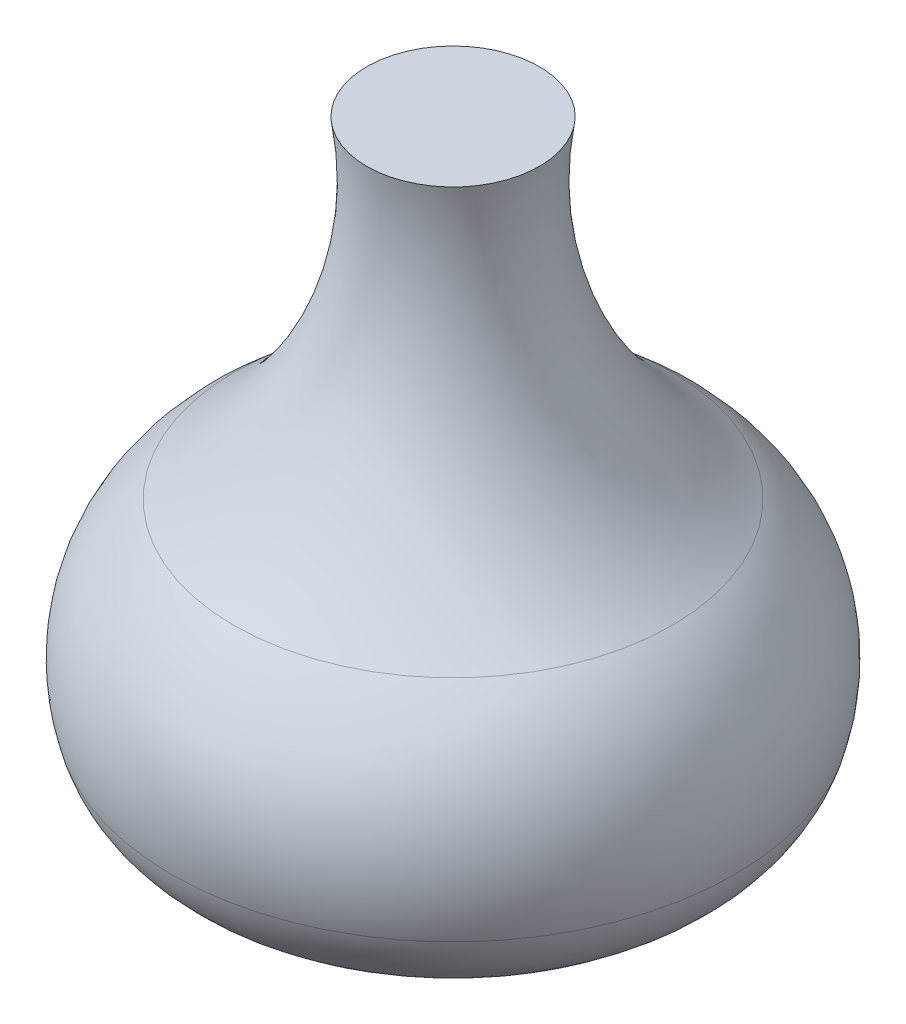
ISO-10303-21;
HEADER;
FILE_DESCRIPTION(('STEP AP214'),'2;1');
FILE_NAME('part.step','',(''),(''),'','','');
FILE_SCHEMA(('AUTOMOTIVE_DESIGN { 1 0 10303 214 1 1 1 1 }'));
ENDSEC;
DATA;
#1=APPLICATION_CONTEXT('core data for automotive mechanical design processes');
#2=APPLICATION_PROTOCOL_DEFINITION('international standard','automotive_design',2000,#1);
#3=PRODUCT_CONTEXT('',#1,'mechanical');
#4=PRODUCT('Part','Part','',(#3));
#5=PRODUCT_RELATED_PRODUCT_CATEGORY('part','',(#4));
#6=PRODUCT_DEFINITION_FORMATION('','',#4);
#7=PRODUCT_DEFINITION_CONTEXT('part definition',#1,'design');
#8=PRODUCT_DEFINITION('design','',#6,#7);
#9=PRODUCT_DEFINITION_SHAPE('','',#8);
#10=(LENGTH_UNIT() NAMED_UNIT(*) SI_UNIT(.MILLI.,.METRE.));
#11=(NAMED_UNIT(*) PLANE_ANGLE_UNIT() SI_UNIT($,.RADIAN.));
#12=(NAMED_UNIT(*) SI_UNIT($,.STERADIAN.) SOLID_ANGLE_UNIT());
#13=UNCERTAINTY_MEASURE_WITH_UNIT(LENGTH_MEASURE(1.E-05),#10,'distance_accuracy_value','');
#14=(GEOMETRIC_REPRESENTATION_CONTEXT(3) GLOBAL_UNCERTAINTY_ASSIGNED_CONTEXT((#13)) GLOBAL_UNIT_ASSIGNED_CONTEXT((#10,
#11,#12)) REPRESENTATION_CONTEXT('',''));
#15=CARTESIAN_POINT('',(0.,0.,0.));
#16=DIRECTION('',(0.,0.,1.));
#17=DIRECTION('',(1.,0.,0.));
#18=AXIS2_PLACEMENT_3D('',#15,#16,#17);
#19=CARTESIAN_POINT('',(0.,53.0411764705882,0.));
#20=DIRECTION('',(0.,1.,0.));
#21=DIRECTION('',(0.,0.,1.));
#22=AXIS2_PLACEMENT_3D('',#19,#20,#21);
#23=PLANE('',#22);
#24=CARTESIAN_POINT('',(0.,53.0411764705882,0.));
#25=DIRECTION('',(0.,1.,0.));
#26=DIRECTION('',(0.,0.,1.));
#27=AXIS2_PLACEMENT_3D('',#24,#25,#26);
#28=CIRCLE('',#27,15.);
#29=CARTESIAN_POINT('',(0.,53.0411764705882,15.));
#30=VERTEX_POINT('',#29);
#31=EDGE_CURVE('E10',#30,#30,#28,.T.);
#32=ORIENTED_EDGE('',*,*,#31,.T.);
#33=EDGE_LOOP('',(#32));
#34=FACE_BOUND('',#33,.T.);
#35=ADVANCED_FACE('F29',(#34),#23,.T.);
#36=CARTESIAN_POINT('',(0.,43.4006403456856,0.));
#37=DIRECTION('',(0.,1.,0.));
#38=DIRECTION('',(0.,0.,1.));
#39=AXIS2_PLACEMENT_3D('',#36,#37,#38);
#40=TOROIDAL_SURFACE('',#39,74.2204361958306,60.);
#41=CARTESIAN_POINT('',(0.,-4.48702608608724,0.));
#42=DIRECTION('',(0.,1.,0.));
#43=DIRECTION('',(0.,0.,1.));
#44=AXIS2_PLACEMENT_3D('',#41,#42,#43);
#45=CIRCLE('',#44,38.0711429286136);
#46=CARTESIAN_POINT('',(0.,-4.48702608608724,38.0711429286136));
#47=VERTEX_POINT('',#46);
#48=EDGE_CURVE('E35',#47,#47,#45,.T.);
#49=ORIENTED_EDGE('',*,*,#48,.T.);
#50=EDGE_LOOP('',(#49));
#51=FACE_BOUND('',#50,.T.);
#52=ORIENTED_EDGE('',*,*,#31,.F.);
#53=EDGE_LOOP('',(#52));
#54=FACE_BOUND('',#53,.T.);
#55=ADVANCED_FACE('F61',(#51,#54),#40,.F.);
#56=CARTESIAN_POINT('',(0.,-28.4308593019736,0.));
#57=DIRECTION('',(0.,1.,0.));
#58=DIRECTION('',(0.,0.,1.));
#59=AXIS2_PLACEMENT_3D('',#56,#57,#58);
#60=DEGENERATE_TOROIDAL_SURFACE('',#59,19.9964962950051,30.,.T.);
#61=CARTESIAN_POINT('',(0.,-36.5824190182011,0.));
#62=DIRECTION('',(0.,1.,0.));
#63=DIRECTION('',(0.,0.,1.));
#64=AXIS2_PLACEMENT_3D('',#61,#62,#63);
#65=CIRCLE('',#64,48.8677982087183);
#66=CARTESIAN_POINT('',(0.,-36.5824190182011,48.8677982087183));
#67=VERTEX_POINT('',#66);
#68=EDGE_CURVE('E39',#67,#67,#65,.T.);
#69=ORIENTED_EDGE('',*,*,#68,.T.);
#70=EDGE_LOOP('',(#69));
#71=FACE_BOUND('',#70,.T.);
#72=ORIENTED_EDGE('',*,*,#48,.F.);
#73=EDGE_LOOP('',(#72));
#74=FACE_BOUND('',#73,.T.);
#75=ADVANCED_FACE('F58',(#71,#74),#60,.T.);
#76=CARTESIAN_POINT('',(0.,-31.1480458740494,0.));
#77=DIRECTION('',(0.,1.,0.));
#78=DIRECTION('',(0.,0.,1.));
#79=AXIS2_PLACEMENT_3D('',#76,#77,#78);
#80=TOROIDAL_SURFACE('',#79,29.6202635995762,20.);
#81=CARTESIAN_POINT('',(0.,-49.791534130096,0.));
#82=DIRECTION('',(0.,1.,0.));
#83=DIRECTION('',(0.,0.,1.));
#84=AXIS2_PLACEMENT_3D('',#81,#82,#83);
#85=CIRCLE('',#84,36.8604532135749);
#86=CARTESIAN_POINT('',(0.,-49.791534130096,36.8604532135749));
#87=VERTEX_POINT('',#86);
#88=EDGE_CURVE('E43',#87,#87,#85,.T.);
#89=ORIENTED_EDGE('',*,*,#88,.T.);
#90=EDGE_LOOP('',(#89));
#91=FACE_BOUND('',#90,.T.);
#92=ORIENTED_EDGE('',*,*,#68,.F.);
#93=EDGE_LOOP('',(#92));
#94=FACE_BOUND('',#93,.T.);
#95=ADVANCED_FACE('F49',(#91,#94),#80,.T.);
#96=CARTESIAN_POINT('',(-36.8604532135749,-49.791534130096,0.));
#97=DIRECTION('',(0.,-1.,0.));
#98=DIRECTION('',(0.,0.,-1.));
#99=AXIS2_PLACEMENT_3D('',#96,#97,#98);
#100=PLANE('',#99);
#101=ORIENTED_EDGE('',*,*,#88,.F.);
#102=EDGE_LOOP('',(#101));
#103=FACE_BOUND('',#102,.T.);
#104=ADVANCED_FACE('F52',(#103),#100,.T.);
#105=CLOSED_SHELL('',(#35,#55,#75,#95,#104));
#106=MANIFOLD_SOLID_BREP('B2',#105);
#107=ADVANCED_BREP_SHAPE_REPRESENTATION('',(#18,#106),#14);
#108=SHAPE_DEFINITION_REPRESENTATION(#9,#107);
ENDSEC;
END-ISO-10303-21;
